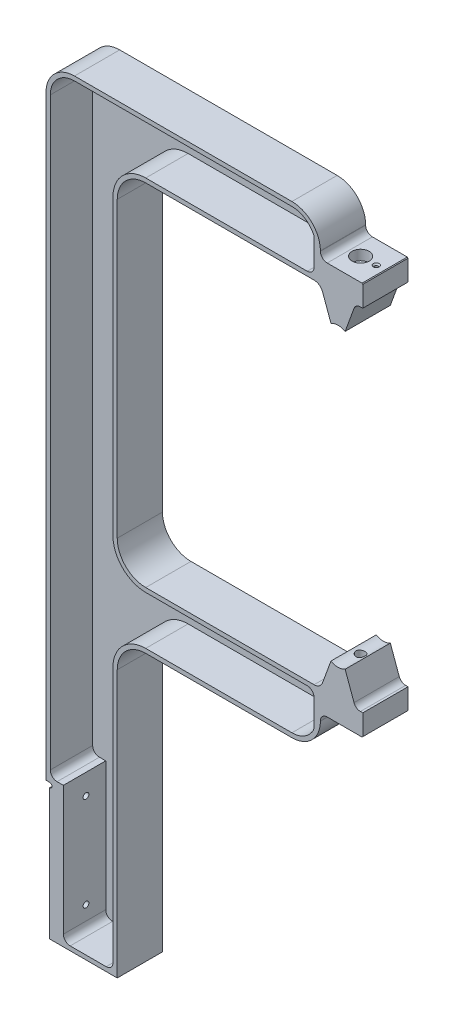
from build123d import *

# Parameters (mm, degrees)
BOSS_EXTRUDE1_DEPTH              = 15.875
SKETCH13_W                       = 2.54
SKETCH13_H                       = 95.25
CUT_EXTRUDE2_DEPTH               = 520.58947497
SKETCH14_W                       = 1.6002
SKETCH14_H                       = 3.302
CUT_EXTRUDE3_DEPTH               = 520.58947497
FILLET4_R                        = 1.5875
FILLET1_R                        = 6.35
FILLET2_R                        = 20
FILLET3_R                        = 4.7625
SKETCH10_R                       = 6
CUT_EXTRUDE1_DEPTH               = 7
F_4_40_TAPPED_HOLE1_D            = 2.2606
F_4_40_TAPPED_HOLE1_DEPTH        = 7.6
F_4_40_TAPPED_HOLE1_CSINK_D      = 4.1148
F_4_40_TAPPED_HOLE1_CSINK_ANGLE  = 90
F_4_40_TAPPED_HOLE1_TIP          = 0.679152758
CHAMFER1_SIZE                    = 0.5
F_10_32_TAPPED_HOLE1_D           = 4.0386
F_10_32_TAPPED_HOLE1_DEPTH       = 12.03
F_10_32_TAPPED_HOLE1_CSINK_D     = 6.096
F_10_32_TAPPED_HOLE1_CSINK_ANGLE = 90
F_10_32_TAPPED_HOLE1_TIP         = 1.213317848
CUT_EXTRUDE7_DEPTH               = 29.75
FILLET5_R                        = 4.7625


with BuildPart() as part:
    # Sketch1 → Boss-Extrude1 (new, symmetric)
    with BuildSketch(Plane.XY):
        with BuildLine():
            Line((-313, -123), (-176.364963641, -123))
            Line((-176.364963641, -123), (-170.374987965, -123))
            Line((-170.374987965, -123), (-162.97678843, -102.673613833))
            ThreePointArc((-162.97678843, -102.673613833), (-158, -104), (-153.02321157, -102.673613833))
            Line((-153.02321157, -102.673613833), (-145.625012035, -123))
            Line((-145.625012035, -123), (-140.625012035, -123))
            Line((-140.625012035, -123), (-140.625012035, -138))
            Line((-140.625012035, -138), (-145.625012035, -138))
            Line((-145.625012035, -138), (-170.374987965, -138))
            Line((-170.374987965, -138), (-170.374987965, -163))
            Line((-170.374987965, -163), (-313, -163))
            Line((-313, -163), (-313, -370.4))
            Line((-313, -370.4), (-363, -370.4))
            Line((-363, -370.4), (-363, -163))
            Line((-363, -163), (-363, 163))
            Line((-363, 163), (-170.374987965, 163))
            Line((-170.374987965, 163), (-170.374987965, 138))
            Line((-170.374987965, 138), (-145.625012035, 138))
            Line((-145.625012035, 138), (-140.625012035, 138))
            Line((-140.625012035, 138), (-140.625012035, 123))
            Line((-140.625012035, 123), (-145.625012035, 123))
            Line((-145.625012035, 123), (-153.02321157, 102.673613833))
            ThreePointArc((-153.02321157, 102.673613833), (-158, 104), (-162.97678843, 102.673613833))
            Line((-162.97678843, 102.673613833), (-170.374987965, 123))
            Line((-170.374987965, 123), (-176.364963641, 123))
            Line((-176.364963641, 123), (-313, 123))
            Line((-313, 123), (-313, -123))
        make_face()
    extrude(amount=BOSS_EXTRUDE1_DEPTH, both=True)

    # Sketch13 → Cut-Extrude2 (cut, through all)
    with BuildSketch(Plane.XY.offset(15.875)):
        with Locations((-361.73, -322.775)):
            Rectangle(SKETCH13_W, SKETCH13_H)
    extrude(amount=-CUT_EXTRUDE2_DEPTH, mode=Mode.SUBTRACT)

    # Sketch14 → Cut-Extrude3 (cut, through all)
    with BuildSketch(Plane.XY.offset(15.875)):
        with Locations((-359.6599, -276.801)):
            Rectangle(SKETCH14_W, SKETCH14_H)
    extrude(amount=-CUT_EXTRUDE3_DEPTH, mode=Mode.SUBTRACT)

    # Fillet4
    fillet4_edges = [part.edges().sort_by_distance(p)[0] for p in [
        (-358.8598, -275.15, 0),
        (-358.8598, -278.452, 0),
    ]]
    fillet(fillet4_edges, radius=FILLET4_R)

    # Fillet1
    fillet1_edges = [part.edges().sort_by_distance(p)[0] for p in [
        (-170.374987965, -123, 0),
        (-170.374987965, 123, 0),
    ]]
    fillet(fillet1_edges, radius=FILLET1_R)

    # Fillet2
    fillet2_edges = [part.edges().sort_by_distance(p)[0] for p in [
        (-313, 123, 0),
        (-313, -123, 0),
        (-170.374987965, -163, 0),
        (-313, -163, 0),
        (-363, 163, 0),
        (-170.374987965, 163, 0),
    ]]
    fillet(fillet2_edges, radius=FILLET2_R)

    # Fillet3
    fillet3_edges = [part.edges().sort_by_distance(p)[0] for p in [
        (-145.625012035, -123, 0),
        (-170.374987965, -138, 0),
        (-170.374987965, 138, 0),
        (-145.625012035, 123, 0),
    ]]
    fillet(fillet3_edges, radius=FILLET3_R)

    # Sketch8 → M6 Clearance Hole1 (revolve, cut)
    with BuildSketch(Plane(origin=(-158, 138, 0), x_dir=(0, 0, 1), z_dir=(1, 0, 0))):
        Polygon((0, 0), (0, 51.960753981), (3.2, 50.038), (3.2, 0), align=None)
    m6_clearance_hole1 = revolve(axis=Axis((-158, 144.35, 0), (0, -1, 0)), mode=Mode.SUBTRACT)

    # Sketch10 → Cut-Extrude1 (cut)
    with BuildSketch(Plane(origin=(0, 138, 0), x_dir=(1, 0, 0), z_dir=(0, 1, 0))):
        with Locations(Location((-158, 0, 0), (0, 0, 270))):
            Circle(SKETCH10_R)
    extrude(amount=-CUT_EXTRUDE1_DEPTH, mode=Mode.SUBTRACT)

    # 4-40 Tapped Hole1
    with Locations(Plane(origin=(0, 138, 0), x_dir=(-1, 0, 0), z_dir=(0, 1, 0))):
        with Locations((147, 0)):
            CounterSinkHole(F_4_40_TAPPED_HOLE1_D / 2, F_4_40_TAPPED_HOLE1_CSINK_D / 2, depth=F_4_40_TAPPED_HOLE1_DEPTH, counter_sink_angle=F_4_40_TAPPED_HOLE1_CSINK_ANGLE)
            with Locations((0, 0, -(F_4_40_TAPPED_HOLE1_DEPTH + F_4_40_TAPPED_HOLE1_TIP / 2))):  # 118° drill point
                Cone(0, F_4_40_TAPPED_HOLE1_D / 2, F_4_40_TAPPED_HOLE1_TIP, mode=Mode.SUBTRACT)

    # Mirror1: M6 Clearance Hole1 across plane
    add(m6_clearance_hole1.mirror(Plane.ZX), mode=Mode.SUBTRACT)

    # Chamfer1
    chamfer1_edges = [part.edges().sort_by_distance(p)[0] for p in [
        (-140.625012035, -138, 0),
        (-140.625012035, 138, 0),
    ]]
    chamfer(chamfer1_edges, length=CHAMFER1_SIZE)

    # 10-32 Tapped Hole1
    with Locations(Plane.ZY.offset(360.46)):
        with Locations((0, -286.58), (0, -352.62)):
            CounterSinkHole(F_10_32_TAPPED_HOLE1_D / 2, F_10_32_TAPPED_HOLE1_CSINK_D / 2, depth=F_10_32_TAPPED_HOLE1_DEPTH, counter_sink_angle=F_10_32_TAPPED_HOLE1_CSINK_ANGLE)
            with Locations((0, 0, -(F_10_32_TAPPED_HOLE1_DEPTH + F_10_32_TAPPED_HOLE1_TIP / 2))):  # 118° drill point
                Cone(0, F_10_32_TAPPED_HOLE1_D / 2, F_10_32_TAPPED_HOLE1_TIP, mode=Mode.SUBTRACT)

    # Sketch25 → Cut-Extrude7 (cut)
    with BuildSketch(Plane.XY.offset(15.875)):
        with BuildLine():
            Line((-190.374987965, 160), (-343, 160))
            ThreePointArc((-343, 160), (-355.02081528, 155.02081528), (-360, 143))
            Line((-360, 143), (-360, -272.15))
            Line((-360, -272.15), (-350.808, -272.15))
            Line((-350.808, -272.15), (-350.808, -367.4))
            Line((-350.808, -367.4), (-316, -367.4))
            Line((-316, -367.4), (-316, -183))
            ThreePointArc((-316, -183), (-309.263455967, -166.736544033), (-293, -160))
            Line((-293, -160), (-190.374987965, -160))
            ThreePointArc((-190.374987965, -160), (-181.091910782, -157.241645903), (-174.821305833, -149.861703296))
            Line((-174.821305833, -149.861703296), (-174.821305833, -126))
            Line((-174.821305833, -126), (-293, -126))
            ThreePointArc((-293, -126), (-309.263455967, -119.263455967), (-316, -103))
            Line((-316, -103), (-316, 103))
            ThreePointArc((-316, 103), (-309.263455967, 119.263455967), (-293, 126))
            Line((-293, 126), (-174.821305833, 126))
            Line((-174.821305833, 126), (-174.821305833, 149.861703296))
            ThreePointArc((-174.821305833, 149.861703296), (-181.091910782, 157.241645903), (-190.374987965, 160))
        make_face()
    extrude(amount=-CUT_EXTRUDE7_DEPTH, mode=Mode.SUBTRACT)

    # Fillet5
    fillet5_edges = [part.edges().sort_by_distance(p)[0] for p in [
        (-350.808, -367.4, 1),
        (-316, -367.4, 1),
        (-174.821305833, -149.861703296, 1),
        (-174.821305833, -126, 1),
        (-174.821305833, 126, 1),
        (-174.821305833, 149.861703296, 1),
        (-360, -272.15, 1),
    ]]
    fillet(fillet5_edges, radius=FILLET5_R)


solid = part.part
